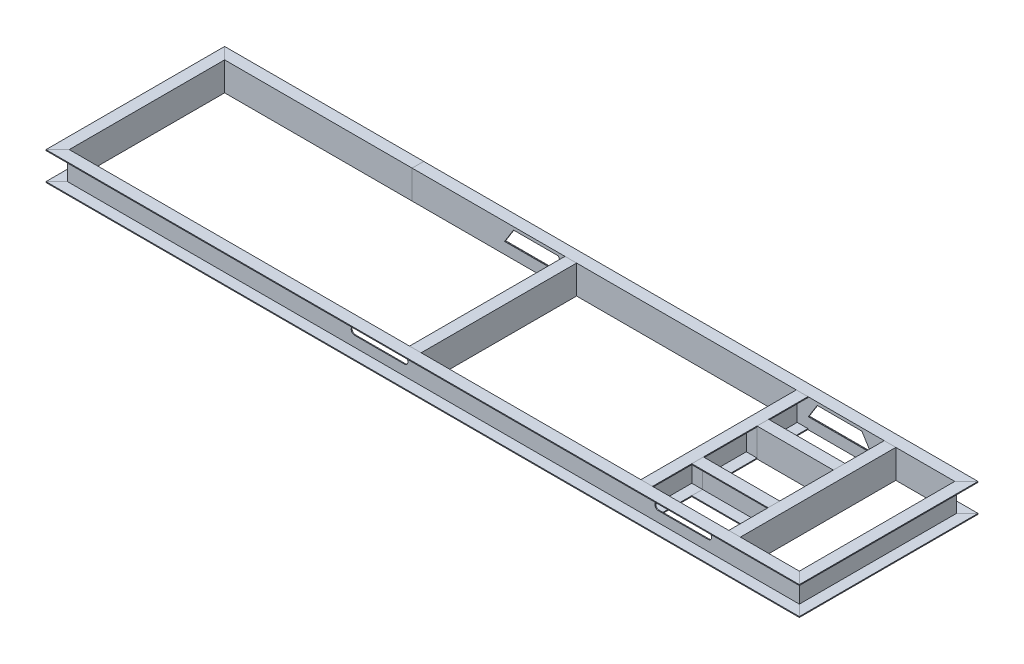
from build123d import *

# Parameters (mm, degrees)
BOSS_EXTRUDE1_DEPTH    = 870
BOSS_EXTRUDE2_DEPTH    = 870
BOSS_EXTRUDE3_DEPTH    = 870
BOSS_EXTRUDE4_DEPTH    = 427
SKETCH11_W             = 5
SKETCH11_H             = 150
BOSS_EXTRUDE5_DEPTH    = 60
SKETCH12_W             = 5
SKETCH12_H             = 150
BOSS_EXTRUDE6_DEPTH    = 60
CUT_EXTRUDE1_DEPTH     = 3246.801761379
FILLET1_R              = 20
LPATTERN1_COUNT        = 2
LPATTERN1_PITCH        = 1700
FILLET1_OF_LPATTERN1_R = 20


with BuildPart() as part:
    # Sweep1: sweep along a path in Sketch2
    with BuildLine(Plane(origin=(0, 0, 0), x_dir=(1, 0, 0), z_dir=(0, 1, 0))) as sweep1_path:
        Line((0, 0), (3037.584257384, 0))
        Line((3037.584257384, 0), (3037.584257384, -870))
        Line((3037.584257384, -870), (-1049.415742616, -870))
        Line((-1049.415742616, -870), (-1049.415742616, 0))
        Line((-1049.415742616, 0), (0, 0))
    # Sketch1 → Sweep1 (sweep)
    with BuildSketch(Plane(origin=(0, 0, 0), x_dir=(0, 0, -1), z_dir=(1, 0, 0))):
        Polygon((65, 160), (0, 160), (0, 0), (65, 0), (65, 5), (5, 5), (5, 155), (65, 155), align=None)
    sweep(path=sweep1_path.line, transition=Transition.RIGHT)

    # Sketch13 → Cut-Extrude1 (cut, through all)
    with BuildSketch(Plane.XY.offset(875)):
        Polygon((2217.584257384, 63.333333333), (2567.584257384, 63.333333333), (2517.584257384, 143.333333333), (2267.584257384, 143.333333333), align=None)
    cut_extrude1 = extrude(amount=-CUT_EXTRUDE1_DEPTH, mode=Mode.SUBTRACT)

    # Fillet1
    fillet1_edges = [part.edges().sort_by_distance(p)[0] for p in [
        (2517.584257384, 143.333333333, 872.5),
        (2567.584257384, 63.333333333, 872.5),
        (2217.584257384, 63.333333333, 872.5),
        (2267.584257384, 143.333333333, 872.5),
    ]]
    fillet(fillet1_edges, radius=FILLET1_R)

    # LPattern1: Cut-Extrude1 ×2
    with Locations(*[(-i * LPATTERN1_PITCH, 0, 0) for i in range(1, LPATTERN1_COUNT)]):
        add(cut_extrude1, mode=Mode.SUBTRACT)

    # Fillet1 of LPattern1
    fillet1_of_lpattern1_edges = [part.edges().sort_by_distance(p)[0] for p in [
        (817.584257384, 143.333333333, 872.5),
        (867.584257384, 63.333333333, 872.5),
        (517.584257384, 63.333333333, 872.5),
        (567.584257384, 143.333333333, 872.5),
    ]]
    fillet(fillet1_of_lpattern1_edges, radius=FILLET1_OF_LPATTERN1_R)


with BuildPart() as body_2:
    # Sketch3 → Boss-Extrude1 (new body)
    with BuildSketch(Plane.XY):
        Polygon((2642.584257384, 160), (2707.584257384, 160), (2707.584257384, 0), (2642.584257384, 0), (2642.584257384, 5), (2702.584257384, 5), (2702.584257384, 155), (2642.584257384, 155), align=None)
    extrude(amount=BOSS_EXTRUDE1_DEPTH)


with BuildPart() as body_3:
    # Sketch6 → Boss-Extrude2 (new body)
    with BuildSketch(Plane.XY):
        Polygon((2215.584257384, 160), (2150.584257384, 160), (2150.584257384, 0), (2215.584257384, 0), (2215.584257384, 5), (2155.584257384, 5), (2155.584257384, 155), (2215.584257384, 155), align=None)
    extrude(amount=BOSS_EXTRUDE2_DEPTH)


with BuildPart() as body_4:
    # Sketch7 → Boss-Extrude3 (new body)
    with BuildSketch(Plane.XY):
        Polygon((855.584257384, 160), (920.584257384, 160), (920.584257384, 0), (855.584257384, 0), (855.584257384, 5), (915.584257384, 5), (915.584257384, 155), (855.584257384, 155), align=None)
    extrude(amount=BOSS_EXTRUDE3_DEPTH)


with BuildPart() as body_5:
    # Sketch9 → Boss-Extrude4 (new body)
    with BuildSketch(Plane(origin=(2215.584257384, 0, 0), x_dir=(0, 0, -1), z_dir=(1, 0, 0))):
        Polygon((-650, 160), (-650, 155), (-590, 155), (-590, 5), (-650, 5), (-650, 0), (-585, 0), (-585, 160), align=None)
    extrude(amount=BOSS_EXTRUDE4_DEPTH)


with BuildPart() as body_6:
    # Sketch11 → Boss-Extrude5 (new body)
    with BuildSketch(Plane(origin=(2642.584257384, 0, 0), x_dir=(0, 0, -1), z_dir=(1, 0, 0))):
        with Locations((-587.5, 80)):
            Rectangle(SKETCH11_W, SKETCH11_H)
    extrude(amount=BOSS_EXTRUDE5_DEPTH)


with BuildPart() as body_7:
    # Sketch12 → Boss-Extrude6 (new body)
    with BuildSketch(Plane.ZY.offset(-2215.584257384)):
        with Locations((587.5, 80)):
            Rectangle(SKETCH12_W, SKETCH12_H)
    extrude(amount=BOSS_EXTRUDE6_DEPTH)


with BuildPart() as body_8:
    # Mirror2: mirrored copy
    add(body_5.part.mirror(Plane.XY.offset(435)))


with BuildPart() as body_9:
    # Mirror2 2: mirrored copy
    add(body_7.part.mirror(Plane.XY.offset(435)))


with BuildPart() as body_10:
    # Mirror2 3: mirrored copy
    add(body_6.part.mirror(Plane.XY.offset(435)))


solid = Compound([part.part, body_2.part, body_3.part, body_4.part, body_5.part, body_6.part, body_7.part, body_8.part, body_9.part, body_10.part])
